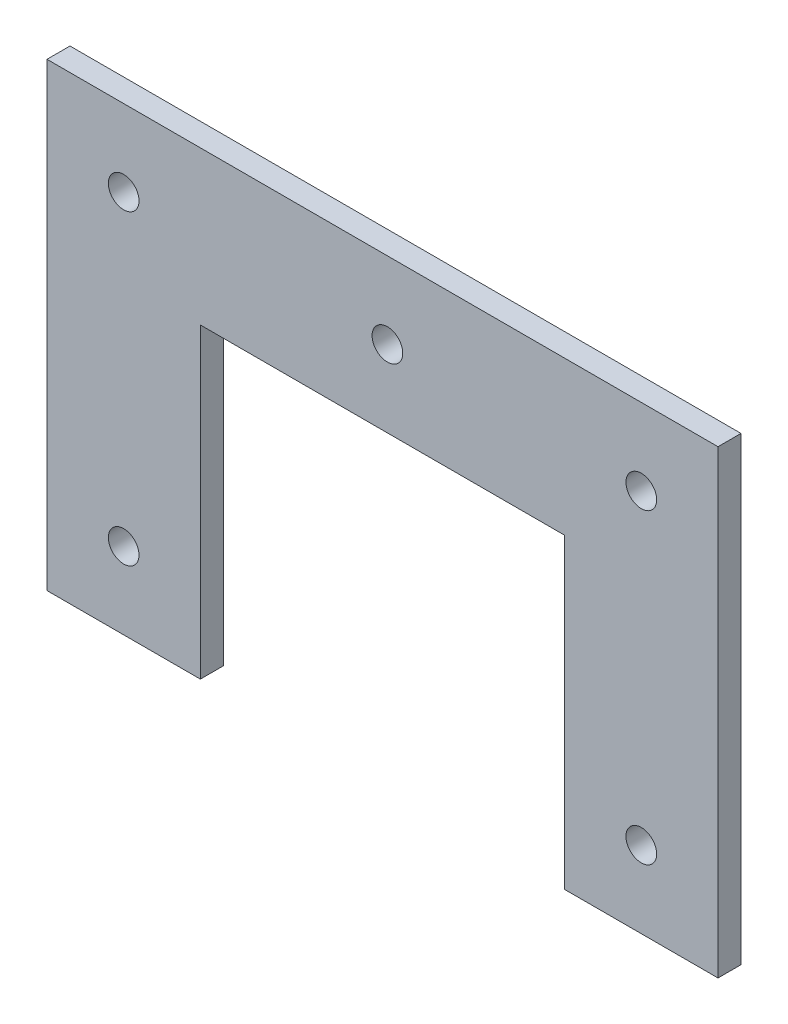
from build123d import *

# Parameters (mm, degrees)
SKETCH_4_W            = 87.5
SKETCH_4_H            = 60
EXTRUDE_2_DEPTH       = 3
SKETCH_5_W            = 47.5
SKETCH_5_H            = 40
CUT_EXTRUDE_1_DEPTH   = 3
HOLE_WIZARD_4_0_4_2_D = 4


with BuildPart() as part:
    # Sketch 4 → Extrude 2 (new body)
    with BuildSketch(Plane.XY):
        Rectangle(SKETCH_4_W, SKETCH_4_H)
    extrude(amount=EXTRUDE_2_DEPTH)

    # Sketch 5 → Cut-Extrude 1 (cut)
    with BuildSketch(Plane.XY.offset(3)):
        with Locations((0, -10)):
            Rectangle(SKETCH_5_W, SKETCH_5_H)
    extrude(amount=-CUT_EXTRUDE_1_DEPTH, mode=Mode.SUBTRACT)

    # Hole Wizard 4.0 _4_ _2 (through all)
    with Locations(Plane.XY.offset(3)):
        with Locations((-33.75, -20), (-33.75, 20), (0.640947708, 20), (33.75, 20), (33.75, -20)):
            Hole(HOLE_WIZARD_4_0_4_2_D / 2)


solid = part.part
